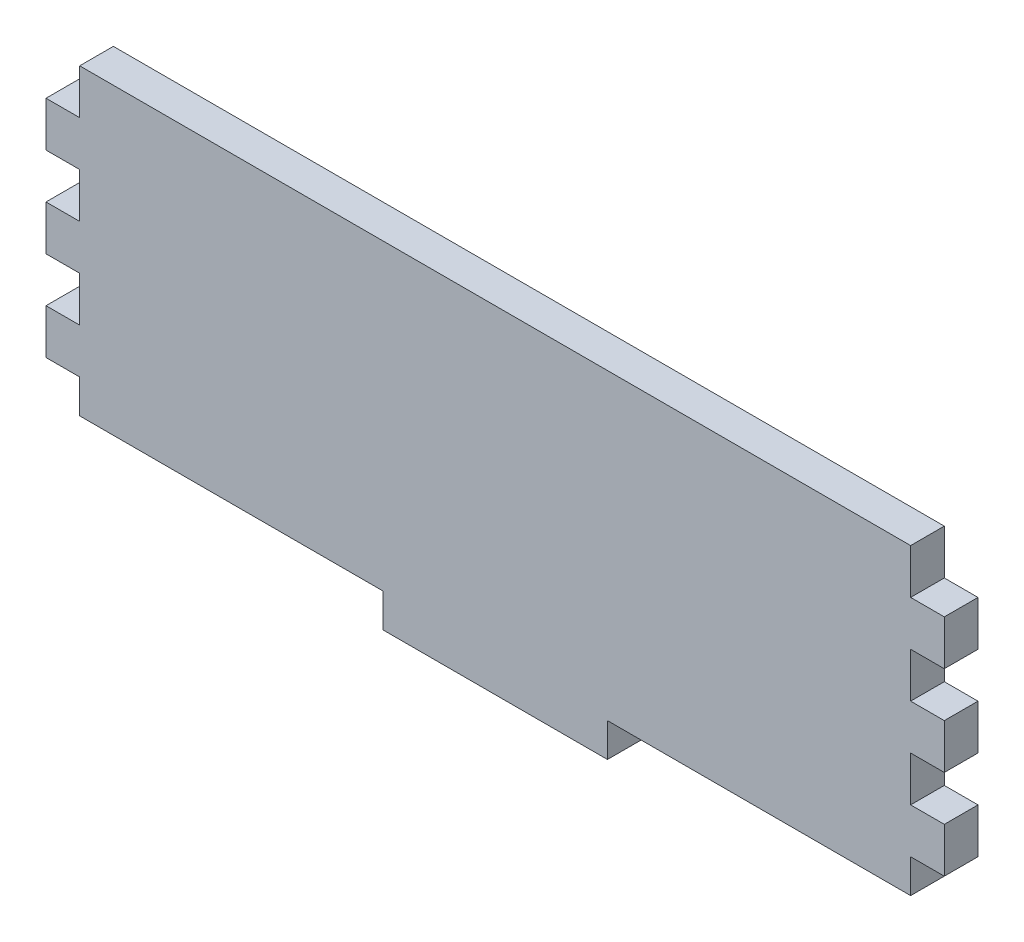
ISO-10303-21;
HEADER;
FILE_DESCRIPTION(('STEP AP214'),'2;1');
FILE_NAME('part.step','',(''),(''),'','','');
FILE_SCHEMA(('AUTOMOTIVE_DESIGN { 1 0 10303 214 1 1 1 1 }'));
ENDSEC;
DATA;
#1=APPLICATION_CONTEXT('core data for automotive mechanical design processes');
#2=APPLICATION_PROTOCOL_DEFINITION('international standard','automotive_design',2000,#1);
#3=PRODUCT_CONTEXT('',#1,'mechanical');
#4=PRODUCT('Part','Part','',(#3));
#5=PRODUCT_RELATED_PRODUCT_CATEGORY('part','',(#4));
#6=PRODUCT_DEFINITION_FORMATION('','',#4);
#7=PRODUCT_DEFINITION_CONTEXT('part definition',#1,'design');
#8=PRODUCT_DEFINITION('design','',#6,#7);
#9=PRODUCT_DEFINITION_SHAPE('','',#8);
#10=(LENGTH_UNIT() NAMED_UNIT(*) SI_UNIT(.MILLI.,.METRE.));
#11=(NAMED_UNIT(*) PLANE_ANGLE_UNIT() SI_UNIT($,.RADIAN.));
#12=(NAMED_UNIT(*) SI_UNIT($,.STERADIAN.) SOLID_ANGLE_UNIT());
#13=UNCERTAINTY_MEASURE_WITH_UNIT(LENGTH_MEASURE(1.E-05),#10,'distance_accuracy_value','');
#14=(GEOMETRIC_REPRESENTATION_CONTEXT(3) GLOBAL_UNCERTAINTY_ASSIGNED_CONTEXT((#13)) GLOBAL_UNIT_ASSIGNED_CONTEXT((#10,
#11,#12)) REPRESENTATION_CONTEXT('',''));
#15=CARTESIAN_POINT('',(0.,0.,0.));
#16=DIRECTION('',(0.,0.,1.));
#17=DIRECTION('',(1.,0.,0.));
#18=AXIS2_PLACEMENT_3D('',#15,#16,#17);
#19=CARTESIAN_POINT('',(200.,-60.,15.));
#20=DIRECTION('',(-1.,0.,0.));
#21=DIRECTION('',(0.,-1.,0.));
#22=AXIS2_PLACEMENT_3D('',#19,#20,#21);
#23=PLANE('',#22);
#24=DIRECTION('',(0.,1.,0.));
#25=VECTOR('',#24,1.);
#26=CARTESIAN_POINT('',(200.,-60.,0.));
#27=LINE('',#26,#25);
#28=CARTESIAN_POINT('',(200.,35.,0.));
#29=VERTEX_POINT('',#28);
#30=CARTESIAN_POINT('',(200.,55.,0.));
#31=VERTEX_POINT('',#30);
#32=EDGE_CURVE('E267',#29,#31,#27,.T.);
#33=ORIENTED_EDGE('',*,*,#32,.T.);
#34=DIRECTION('',(0.,0.,1.));
#35=VECTOR('',#34,1.);
#36=CARTESIAN_POINT('',(200.,55.,0.));
#37=LINE('',#36,#35);
#38=CARTESIAN_POINT('',(200.,55.,15.));
#39=VERTEX_POINT('',#38);
#40=EDGE_CURVE('E275',#31,#39,#37,.T.);
#41=ORIENTED_EDGE('',*,*,#40,.T.);
#42=DIRECTION('',(0.,1.,0.));
#43=VECTOR('',#42,1.);
#44=CARTESIAN_POINT('',(200.,-60.,15.));
#45=LINE('',#44,#43);
#46=CARTESIAN_POINT('',(200.,35.,15.));
#47=VERTEX_POINT('',#46);
#48=EDGE_CURVE('E432',#47,#39,#45,.T.);
#49=ORIENTED_EDGE('',*,*,#48,.F.);
#50=DIRECTION('',(0.,0.,1.));
#51=VECTOR('',#50,1.);
#52=CARTESIAN_POINT('',(200.,35.,0.));
#53=LINE('',#52,#51);
#54=EDGE_CURVE('E277',#29,#47,#53,.T.);
#55=ORIENTED_EDGE('',*,*,#54,.F.);
#56=EDGE_LOOP('',(#33,#41,#49,#55));
#57=FACE_BOUND('',#56,.T.);
#58=ADVANCED_FACE('F33',(#57),#23,.F.);
#59=CARTESIAN_POINT('',(200.,-5.00000000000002,0.));
#60=VERTEX_POINT('',#59);
#61=CARTESIAN_POINT('',(200.,15.,0.));
#62=VERTEX_POINT('',#61);
#63=EDGE_CURVE('E457',#60,#62,#27,.T.);
#64=ORIENTED_EDGE('',*,*,#63,.T.);
#65=DIRECTION('',(0.,0.,1.));
#66=VECTOR('',#65,1.);
#67=CARTESIAN_POINT('',(200.,15.,0.));
#68=LINE('',#67,#66);
#69=CARTESIAN_POINT('',(200.,15.,15.));
#70=VERTEX_POINT('',#69);
#71=EDGE_CURVE('E280',#62,#70,#68,.T.);
#72=ORIENTED_EDGE('',*,*,#71,.T.);
#73=CARTESIAN_POINT('',(200.,-5.00000000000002,15.));
#74=VERTEX_POINT('',#73);
#75=EDGE_CURVE('E436',#74,#70,#45,.T.);
#76=ORIENTED_EDGE('',*,*,#75,.F.);
#77=DIRECTION('',(0.,0.,1.));
#78=VECTOR('',#77,1.);
#79=CARTESIAN_POINT('',(200.,-5.00000000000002,0.));
#80=LINE('',#79,#78);
#81=EDGE_CURVE('E374',#60,#74,#80,.T.);
#82=ORIENTED_EDGE('',*,*,#81,.F.);
#83=EDGE_LOOP('',(#64,#72,#76,#82));
#84=FACE_BOUND('',#83,.T.);
#85=ADVANCED_FACE('F550',(#84),#23,.F.);
#86=CARTESIAN_POINT('',(-200.,-60.,15.));
#87=DIRECTION('',(-1.,0.,0.));
#88=DIRECTION('',(0.,0.,1.));
#89=AXIS2_PLACEMENT_3D('',#86,#87,#88);
#90=PLANE('',#89);
#91=DIRECTION('',(0.,0.,1.));
#92=VECTOR('',#91,1.);
#93=CARTESIAN_POINT('',(-200.,-5.00000000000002,0.));
#94=LINE('',#93,#92);
#95=CARTESIAN_POINT('',(-200.,-5.00000000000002,0.));
#96=VERTEX_POINT('',#95);
#97=CARTESIAN_POINT('',(-200.,-5.00000000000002,15.));
#98=VERTEX_POINT('',#97);
#99=EDGE_CURVE('E346',#96,#98,#94,.T.);
#100=ORIENTED_EDGE('',*,*,#99,.T.);
#101=DIRECTION('',(0.,1.,0.));
#102=VECTOR('',#101,1.);
#103=CARTESIAN_POINT('',(-200.,-60.,15.));
#104=LINE('',#103,#102);
#105=CARTESIAN_POINT('',(-200.,15.,15.));
#106=VERTEX_POINT('',#105);
#107=EDGE_CURVE('E442',#98,#106,#104,.T.);
#108=ORIENTED_EDGE('',*,*,#107,.T.);
#109=DIRECTION('',(0.,0.,1.));
#110=VECTOR('',#109,1.);
#111=CARTESIAN_POINT('',(-200.,15.,0.));
#112=LINE('',#111,#110);
#113=CARTESIAN_POINT('',(-200.,15.,0.));
#114=VERTEX_POINT('',#113);
#115=EDGE_CURVE('E341',#114,#106,#112,.T.);
#116=ORIENTED_EDGE('',*,*,#115,.F.);
#117=DIRECTION('',(0.,1.,0.));
#118=VECTOR('',#117,1.);
#119=CARTESIAN_POINT('',(-200.,-60.,0.));
#120=LINE('',#119,#118);
#121=EDGE_CURVE('E463',#96,#114,#120,.T.);
#122=ORIENTED_EDGE('',*,*,#121,.F.);
#123=EDGE_LOOP('',(#100,#108,#116,#122));
#124=FACE_BOUND('',#123,.T.);
#125=ADVANCED_FACE('F522',(#124),#90,.T.);
#126=DIRECTION('',(0.,0.,1.));
#127=VECTOR('',#126,1.);
#128=CARTESIAN_POINT('',(-200.,35.,0.));
#129=LINE('',#128,#127);
#130=CARTESIAN_POINT('',(-200.,35.,0.));
#131=VERTEX_POINT('',#130);
#132=CARTESIAN_POINT('',(-200.,35.,15.));
#133=VERTEX_POINT('',#132);
#134=EDGE_CURVE('E350',#131,#133,#129,.T.);
#135=ORIENTED_EDGE('',*,*,#134,.T.);
#136=CARTESIAN_POINT('',(-200.,55.,15.));
#137=VERTEX_POINT('',#136);
#138=EDGE_CURVE('E440',#133,#137,#104,.T.);
#139=ORIENTED_EDGE('',*,*,#138,.T.);
#140=DIRECTION('',(0.,0.,1.));
#141=VECTOR('',#140,1.);
#142=CARTESIAN_POINT('',(-200.,55.,0.));
#143=LINE('',#142,#141);
#144=CARTESIAN_POINT('',(-200.,55.,0.));
#145=VERTEX_POINT('',#144);
#146=EDGE_CURVE('E416',#145,#137,#143,.T.);
#147=ORIENTED_EDGE('',*,*,#146,.F.);
#148=EDGE_CURVE('E461',#131,#145,#120,.T.);
#149=ORIENTED_EDGE('',*,*,#148,.F.);
#150=EDGE_LOOP('',(#135,#139,#147,#149));
#151=FACE_BOUND('',#150,.T.);
#152=ADVANCED_FACE('F566',(#151),#90,.T.);
#153=CARTESIAN_POINT('',(50.,-60.,15.));
#154=DIRECTION('',(0.,1.,0.));
#155=DIRECTION('',(0.,0.,1.));
#156=AXIS2_PLACEMENT_3D('',#153,#154,#155);
#157=PLANE('',#156);
#158=DIRECTION('',(1.,0.,0.));
#159=VECTOR('',#158,1.);
#160=CARTESIAN_POINT('',(50.,-60.,0.));
#161=LINE('',#160,#159);
#162=CARTESIAN_POINT('',(50.,-60.,0.));
#163=VERTEX_POINT('',#162);
#164=CARTESIAN_POINT('',(185.,-60.,0.));
#165=VERTEX_POINT('',#164);
#166=EDGE_CURVE('E424',#163,#165,#161,.T.);
#167=ORIENTED_EDGE('',*,*,#166,.T.);
#168=DIRECTION('',(0.,0.,1.));
#169=VECTOR('',#168,1.);
#170=CARTESIAN_POINT('',(185.,-60.,0.));
#171=LINE('',#170,#169);
#172=CARTESIAN_POINT('',(185.,-60.,15.));
#173=VERTEX_POINT('',#172);
#174=EDGE_CURVE('E310',#165,#173,#171,.T.);
#175=ORIENTED_EDGE('',*,*,#174,.T.);
#176=DIRECTION('',(1.,0.,0.));
#177=VECTOR('',#176,1.);
#178=CARTESIAN_POINT('',(50.,-60.,15.));
#179=LINE('',#178,#177);
#180=CARTESIAN_POINT('',(50.,-60.,15.));
#181=VERTEX_POINT('',#180);
#182=EDGE_CURVE('E429',#181,#173,#179,.T.);
#183=ORIENTED_EDGE('',*,*,#182,.F.);
#184=DIRECTION('',(0.,0.,-1.));
#185=VECTOR('',#184,1.);
#186=CARTESIAN_POINT('',(50.,-60.,15.));
#187=LINE('',#186,#185);
#188=EDGE_CURVE('E453',#181,#163,#187,.T.);
#189=ORIENTED_EDGE('',*,*,#188,.T.);
#190=EDGE_LOOP('',(#167,#175,#183,#189));
#191=FACE_BOUND('',#190,.T.);
#192=ADVANCED_FACE('F35',(#191),#157,.F.);
#193=CARTESIAN_POINT('',(200.,-45.,15.));
#194=VERTEX_POINT('',#193);
#195=CARTESIAN_POINT('',(200.,-25.,15.));
#196=VERTEX_POINT('',#195);
#197=EDGE_CURVE('E437',#194,#196,#45,.T.);
#198=ORIENTED_EDGE('',*,*,#197,.F.);
#199=DIRECTION('',(0.,0.,1.));
#200=VECTOR('',#199,1.);
#201=CARTESIAN_POINT('',(200.,-45.,0.));
#202=LINE('',#201,#200);
#203=CARTESIAN_POINT('',(200.,-45.,0.));
#204=VERTEX_POINT('',#203);
#205=EDGE_CURVE('E321',#204,#194,#202,.T.);
#206=ORIENTED_EDGE('',*,*,#205,.F.);
#207=CARTESIAN_POINT('',(200.,-25.,0.));
#208=VERTEX_POINT('',#207);
#209=EDGE_CURVE('E458',#204,#208,#27,.T.);
#210=ORIENTED_EDGE('',*,*,#209,.T.);
#211=DIRECTION('',(0.,0.,1.));
#212=VECTOR('',#211,1.);
#213=CARTESIAN_POINT('',(200.,-25.,0.));
#214=LINE('',#213,#212);
#215=EDGE_CURVE('E403',#208,#196,#214,.T.);
#216=ORIENTED_EDGE('',*,*,#215,.T.);
#217=EDGE_LOOP('',(#198,#206,#210,#216));
#218=FACE_BOUND('',#217,.T.);
#219=ADVANCED_FACE('F552',(#218),#23,.F.);
#220=CARTESIAN_POINT('',(200.,75.,15.));
#221=DIRECTION('',(0.,-1.,0.));
#222=DIRECTION('',(1.,0.,0.));
#223=AXIS2_PLACEMENT_3D('',#220,#221,#222);
#224=PLANE('',#223);
#225=DIRECTION('',(-1.,0.,0.));
#226=VECTOR('',#225,1.);
#227=CARTESIAN_POINT('',(200.,75.,15.));
#228=LINE('',#227,#226);
#229=CARTESIAN_POINT('',(185.,75.,15.));
#230=VERTEX_POINT('',#229);
#231=CARTESIAN_POINT('',(-185.,75.,15.));
#232=VERTEX_POINT('',#231);
#233=EDGE_CURVE('E438',#230,#232,#228,.T.);
#234=ORIENTED_EDGE('',*,*,#233,.F.);
#235=DIRECTION('',(0.,0.,1.));
#236=VECTOR('',#235,1.);
#237=CARTESIAN_POINT('',(185.,75.,0.));
#238=LINE('',#237,#236);
#239=CARTESIAN_POINT('',(185.,75.,0.));
#240=VERTEX_POINT('',#239);
#241=EDGE_CURVE('E290',#240,#230,#238,.T.);
#242=ORIENTED_EDGE('',*,*,#241,.F.);
#243=DIRECTION('',(-1.,0.,0.));
#244=VECTOR('',#243,1.);
#245=CARTESIAN_POINT('',(200.,75.,0.));
#246=LINE('',#245,#244);
#247=CARTESIAN_POINT('',(-185.,75.,0.));
#248=VERTEX_POINT('',#247);
#249=EDGE_CURVE('E459',#240,#248,#246,.T.);
#250=ORIENTED_EDGE('',*,*,#249,.T.);
#251=DIRECTION('',(0.,0.,1.));
#252=VECTOR('',#251,1.);
#253=CARTESIAN_POINT('',(-185.,75.,0.));
#254=LINE('',#253,#252);
#255=EDGE_CURVE('E421',#248,#232,#254,.T.);
#256=ORIENTED_EDGE('',*,*,#255,.T.);
#257=EDGE_LOOP('',(#234,#242,#250,#256));
#258=FACE_BOUND('',#257,.T.);
#259=ADVANCED_FACE('F559',(#258),#224,.F.);
#260=DIRECTION('',(0.,0.,1.));
#261=VECTOR('',#260,1.);
#262=CARTESIAN_POINT('',(-200.,-45.,0.));
#263=LINE('',#262,#261);
#264=CARTESIAN_POINT('',(-200.,-45.,0.));
#265=VERTEX_POINT('',#264);
#266=CARTESIAN_POINT('',(-200.,-45.,15.));
#267=VERTEX_POINT('',#266);
#268=EDGE_CURVE('E294',#265,#267,#263,.T.);
#269=ORIENTED_EDGE('',*,*,#268,.T.);
#270=CARTESIAN_POINT('',(-200.,-25.,15.));
#271=VERTEX_POINT('',#270);
#272=EDGE_CURVE('E443',#267,#271,#104,.T.);
#273=ORIENTED_EDGE('',*,*,#272,.T.);
#274=DIRECTION('',(0.,0.,1.));
#275=VECTOR('',#274,1.);
#276=CARTESIAN_POINT('',(-200.,-25.,0.));
#277=LINE('',#276,#275);
#278=CARTESIAN_POINT('',(-200.,-25.,0.));
#279=VERTEX_POINT('',#278);
#280=EDGE_CURVE('E369',#279,#271,#277,.T.);
#281=ORIENTED_EDGE('',*,*,#280,.F.);
#282=EDGE_CURVE('E464',#265,#279,#120,.T.);
#283=ORIENTED_EDGE('',*,*,#282,.F.);
#284=EDGE_LOOP('',(#269,#273,#281,#283));
#285=FACE_BOUND('',#284,.T.);
#286=ADVANCED_FACE('F514',(#285),#90,.T.);
#287=CARTESIAN_POINT('',(-200.,-60.,15.));
#288=DIRECTION('',(0.,1.,0.));
#289=DIRECTION('',(0.,0.,1.));
#290=AXIS2_PLACEMENT_3D('',#287,#288,#289);
#291=PLANE('',#290);
#292=DIRECTION('',(1.,0.,0.));
#293=VECTOR('',#292,1.);
#294=CARTESIAN_POINT('',(-200.,-60.,15.));
#295=LINE('',#294,#293);
#296=CARTESIAN_POINT('',(-185.,-60.,15.));
#297=VERTEX_POINT('',#296);
#298=CARTESIAN_POINT('',(-50.,-60.,15.));
#299=VERTEX_POINT('',#298);
#300=EDGE_CURVE('E444',#297,#299,#295,.T.);
#301=ORIENTED_EDGE('',*,*,#300,.F.);
#302=DIRECTION('',(0.,0.,1.));
#303=VECTOR('',#302,1.);
#304=CARTESIAN_POINT('',(-185.,-60.,0.));
#305=LINE('',#304,#303);
#306=CARTESIAN_POINT('',(-185.,-60.,0.));
#307=VERTEX_POINT('',#306);
#308=EDGE_CURVE('E306',#307,#297,#305,.T.);
#309=ORIENTED_EDGE('',*,*,#308,.F.);
#310=DIRECTION('',(1.,0.,0.));
#311=VECTOR('',#310,1.);
#312=CARTESIAN_POINT('',(-200.,-60.,0.));
#313=LINE('',#312,#311);
#314=CARTESIAN_POINT('',(-50.,-60.,0.));
#315=VERTEX_POINT('',#314);
#316=EDGE_CURVE('E465',#307,#315,#313,.T.);
#317=ORIENTED_EDGE('',*,*,#316,.T.);
#318=DIRECTION('',(0.,0.,-1.));
#319=VECTOR('',#318,1.);
#320=CARTESIAN_POINT('',(-50.,-60.,15.));
#321=LINE('',#320,#319);
#322=EDGE_CURVE('E11',#299,#315,#321,.T.);
#323=ORIENTED_EDGE('',*,*,#322,.F.);
#324=EDGE_LOOP('',(#301,#309,#317,#323));
#325=FACE_BOUND('',#324,.T.);
#326=ADVANCED_FACE('F505',(#325),#291,.F.);
#327=CARTESIAN_POINT('',(-50.,-60.,15.));
#328=DIRECTION('',(1.,0.,0.));
#329=DIRECTION('',(0.,1.,0.));
#330=AXIS2_PLACEMENT_3D('',#327,#328,#329);
#331=PLANE('',#330);
#332=DIRECTION('',(0.,-1.,0.));
#333=VECTOR('',#332,1.);
#334=CARTESIAN_POINT('',(-50.,-60.,0.));
#335=LINE('',#334,#333);
#336=CARTESIAN_POINT('',(-50.,-75.,0.));
#337=VERTEX_POINT('',#336);
#338=EDGE_CURVE('E467',#315,#337,#335,.T.);
#339=ORIENTED_EDGE('',*,*,#338,.T.);
#340=DIRECTION('',(0.,0.,-1.));
#341=VECTOR('',#340,1.);
#342=CARTESIAN_POINT('',(-50.,-75.,15.));
#343=LINE('',#342,#341);
#344=CARTESIAN_POINT('',(-50.,-75.,15.));
#345=VERTEX_POINT('',#344);
#346=EDGE_CURVE('E41',#345,#337,#343,.T.);
#347=ORIENTED_EDGE('',*,*,#346,.F.);
#348=DIRECTION('',(0.,-1.,0.));
#349=VECTOR('',#348,1.);
#350=CARTESIAN_POINT('',(-50.,-60.,15.));
#351=LINE('',#350,#349);
#352=EDGE_CURVE('E446',#299,#345,#351,.T.);
#353=ORIENTED_EDGE('',*,*,#352,.F.);
#354=ORIENTED_EDGE('',*,*,#322,.T.);
#355=EDGE_LOOP('',(#339,#347,#353,#354));
#356=FACE_BOUND('',#355,.T.);
#357=ADVANCED_FACE('F485',(#356),#331,.F.);
#358=CARTESIAN_POINT('',(50.,-75.,15.));
#359=DIRECTION('',(0.,-1.,0.));
#360=DIRECTION('',(0.,0.,-1.));
#361=AXIS2_PLACEMENT_3D('',#358,#359,#360);
#362=PLANE('',#361);
#363=DIRECTION('',(-1.,0.,0.));
#364=VECTOR('',#363,1.);
#365=CARTESIAN_POINT('',(50.,-75.,0.));
#366=LINE('',#365,#364);
#367=CARTESIAN_POINT('',(50.,-75.,0.));
#368=VERTEX_POINT('',#367);
#369=EDGE_CURVE('E470',#368,#337,#366,.T.);
#370=ORIENTED_EDGE('',*,*,#369,.F.);
#371=DIRECTION('',(0.,0.,-1.));
#372=VECTOR('',#371,1.);
#373=CARTESIAN_POINT('',(50.,-75.,15.));
#374=LINE('',#373,#372);
#375=CARTESIAN_POINT('',(50.,-75.,15.));
#376=VERTEX_POINT('',#375);
#377=EDGE_CURVE('E476',#376,#368,#374,.T.);
#378=ORIENTED_EDGE('',*,*,#377,.F.);
#379=DIRECTION('',(-1.,0.,0.));
#380=VECTOR('',#379,1.);
#381=CARTESIAN_POINT('',(50.,-75.,15.));
#382=LINE('',#381,#380);
#383=EDGE_CURVE('E448',#376,#345,#382,.T.);
#384=ORIENTED_EDGE('',*,*,#383,.T.);
#385=ORIENTED_EDGE('',*,*,#346,.T.);
#386=EDGE_LOOP('',(#370,#378,#384,#385));
#387=FACE_BOUND('',#386,.T.);
#388=ADVANCED_FACE('F480',(#387),#362,.T.);
#389=CARTESIAN_POINT('',(50.,-75.,15.));
#390=DIRECTION('',(-1.,0.,0.));
#391=DIRECTION('',(0.,-1.,0.));
#392=AXIS2_PLACEMENT_3D('',#389,#390,#391);
#393=PLANE('',#392);
#394=DIRECTION('',(0.,1.,0.));
#395=VECTOR('',#394,1.);
#396=CARTESIAN_POINT('',(50.,-75.,0.));
#397=LINE('',#396,#395);
#398=EDGE_CURVE('E433',#368,#163,#397,.T.);
#399=ORIENTED_EDGE('',*,*,#398,.T.);
#400=ORIENTED_EDGE('',*,*,#188,.F.);
#401=DIRECTION('',(0.,1.,0.));
#402=VECTOR('',#401,1.);
#403=CARTESIAN_POINT('',(50.,-75.,15.));
#404=LINE('',#403,#402);
#405=EDGE_CURVE('E451',#376,#181,#404,.T.);
#406=ORIENTED_EDGE('',*,*,#405,.F.);
#407=ORIENTED_EDGE('',*,*,#377,.T.);
#408=EDGE_LOOP('',(#399,#400,#406,#407));
#409=FACE_BOUND('',#408,.T.);
#410=ADVANCED_FACE('F492',(#409),#393,.F.);
#411=CARTESIAN_POINT('',(0.,0.,15.));
#412=DIRECTION('',(0.,0.,1.));
#413=DIRECTION('',(1.,0.,0.));
#414=AXIS2_PLACEMENT_3D('',#411,#412,#413);
#415=PLANE('',#414);
#416=DIRECTION('',(0.,-1.,0.));
#417=VECTOR('',#416,1.);
#418=CARTESIAN_POINT('',(185.,-45.,15.));
#419=LINE('',#418,#417);
#420=CARTESIAN_POINT('',(185.,-45.,15.));
#421=VERTEX_POINT('',#420);
#422=EDGE_CURVE('E319',#421,#173,#419,.T.);
#423=ORIENTED_EDGE('',*,*,#422,.F.);
#424=DIRECTION('',(-1.,0.,0.));
#425=VECTOR('',#424,1.);
#426=CARTESIAN_POINT('',(200.,-45.,15.));
#427=LINE('',#426,#425);
#428=EDGE_CURVE('E322',#194,#421,#427,.T.);
#429=ORIENTED_EDGE('',*,*,#428,.F.);
#430=ORIENTED_EDGE('',*,*,#197,.T.);
#431=DIRECTION('',(1.,0.,0.));
#432=VECTOR('',#431,1.);
#433=CARTESIAN_POINT('',(200.,-25.,15.));
#434=LINE('',#433,#432);
#435=CARTESIAN_POINT('',(185.,-25.,15.));
#436=VERTEX_POINT('',#435);
#437=EDGE_CURVE('E389',#436,#196,#434,.T.);
#438=ORIENTED_EDGE('',*,*,#437,.F.);
#439=DIRECTION('',(0.,-1.,0.));
#440=VECTOR('',#439,1.);
#441=CARTESIAN_POINT('',(185.,-5.00000000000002,15.));
#442=LINE('',#441,#440);
#443=CARTESIAN_POINT('',(185.,-5.00000000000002,15.));
#444=VERTEX_POINT('',#443);
#445=EDGE_CURVE('E398',#444,#436,#442,.T.);
#446=ORIENTED_EDGE('',*,*,#445,.F.);
#447=DIRECTION('',(-1.,0.,0.));
#448=VECTOR('',#447,1.);
#449=CARTESIAN_POINT('',(200.,-5.00000000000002,15.));
#450=LINE('',#449,#448);
#451=EDGE_CURVE('E279',#74,#444,#450,.T.);
#452=ORIENTED_EDGE('',*,*,#451,.F.);
#453=ORIENTED_EDGE('',*,*,#75,.T.);
#454=DIRECTION('',(1.,0.,0.));
#455=VECTOR('',#454,1.);
#456=CARTESIAN_POINT('',(200.,15.,15.));
#457=LINE('',#456,#455);
#458=CARTESIAN_POINT('',(185.,15.,15.));
#459=VERTEX_POINT('',#458);
#460=EDGE_CURVE('E268',#459,#70,#457,.T.);
#461=ORIENTED_EDGE('',*,*,#460,.F.);
#462=DIRECTION('',(0.,-1.,0.));
#463=VECTOR('',#462,1.);
#464=CARTESIAN_POINT('',(185.,35.,15.));
#465=LINE('',#464,#463);
#466=CARTESIAN_POINT('',(185.,35.,15.));
#467=VERTEX_POINT('',#466);
#468=EDGE_CURVE('E270',#467,#459,#465,.T.);
#469=ORIENTED_EDGE('',*,*,#468,.F.);
#470=DIRECTION('',(-1.,0.,0.));
#471=VECTOR('',#470,1.);
#472=CARTESIAN_POINT('',(200.,35.,15.));
#473=LINE('',#472,#471);
#474=EDGE_CURVE('E248',#47,#467,#473,.T.);
#475=ORIENTED_EDGE('',*,*,#474,.F.);
#476=ORIENTED_EDGE('',*,*,#48,.T.);
#477=DIRECTION('',(1.,0.,0.));
#478=VECTOR('',#477,1.);
#479=CARTESIAN_POINT('',(200.,55.,15.));
#480=LINE('',#479,#478);
#481=CARTESIAN_POINT('',(185.,55.,15.));
#482=VERTEX_POINT('',#481);
#483=EDGE_CURVE('E288',#482,#39,#480,.T.);
#484=ORIENTED_EDGE('',*,*,#483,.F.);
#485=DIRECTION('',(0.,-1.,0.));
#486=VECTOR('',#485,1.);
#487=CARTESIAN_POINT('',(185.,75.,15.));
#488=LINE('',#487,#486);
#489=EDGE_CURVE('E291',#230,#482,#488,.T.);
#490=ORIENTED_EDGE('',*,*,#489,.F.);
#491=ORIENTED_EDGE('',*,*,#233,.T.);
#492=DIRECTION('',(0.,1.,0.));
#493=VECTOR('',#492,1.);
#494=CARTESIAN_POINT('',(-185.,75.,15.));
#495=LINE('',#494,#493);
#496=CARTESIAN_POINT('',(-185.,55.,15.));
#497=VERTEX_POINT('',#496);
#498=EDGE_CURVE('E413',#497,#232,#495,.T.);
#499=ORIENTED_EDGE('',*,*,#498,.F.);
#500=DIRECTION('',(1.,0.,0.));
#501=VECTOR('',#500,1.);
#502=CARTESIAN_POINT('',(-200.,55.,15.));
#503=LINE('',#502,#501);
#504=EDGE_CURVE('E353',#137,#497,#503,.T.);
#505=ORIENTED_EDGE('',*,*,#504,.F.);
#506=ORIENTED_EDGE('',*,*,#138,.F.);
#507=DIRECTION('',(-1.,0.,0.));
#508=VECTOR('',#507,1.);
#509=CARTESIAN_POINT('',(-200.,35.,15.));
#510=LINE('',#509,#508);
#511=CARTESIAN_POINT('',(-185.,35.,15.));
#512=VERTEX_POINT('',#511);
#513=EDGE_CURVE('E335',#512,#133,#510,.T.);
#514=ORIENTED_EDGE('',*,*,#513,.F.);
#515=DIRECTION('',(0.,1.,0.));
#516=VECTOR('',#515,1.);
#517=CARTESIAN_POINT('',(-185.,35.,15.));
#518=LINE('',#517,#516);
#519=CARTESIAN_POINT('',(-185.,15.,15.));
#520=VERTEX_POINT('',#519);
#521=EDGE_CURVE('E345',#520,#512,#518,.T.);
#522=ORIENTED_EDGE('',*,*,#521,.F.);
#523=DIRECTION('',(1.,0.,0.));
#524=VECTOR('',#523,1.);
#525=CARTESIAN_POINT('',(-200.,15.,15.));
#526=LINE('',#525,#524);
#527=EDGE_CURVE('E342',#106,#520,#526,.T.);
#528=ORIENTED_EDGE('',*,*,#527,.F.);
#529=ORIENTED_EDGE('',*,*,#107,.F.);
#530=DIRECTION('',(-1.,0.,0.));
#531=VECTOR('',#530,1.);
#532=CARTESIAN_POINT('',(-200.,-5.00000000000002,15.));
#533=LINE('',#532,#531);
#534=CARTESIAN_POINT('',(-185.,-5.00000000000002,15.));
#535=VERTEX_POINT('',#534);
#536=EDGE_CURVE('E363',#535,#98,#533,.T.);
#537=ORIENTED_EDGE('',*,*,#536,.F.);
#538=DIRECTION('',(0.,1.,0.));
#539=VECTOR('',#538,1.);
#540=CARTESIAN_POINT('',(-185.,-5.00000000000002,15.));
#541=LINE('',#540,#539);
#542=CARTESIAN_POINT('',(-185.,-25.,15.));
#543=VERTEX_POINT('',#542);
#544=EDGE_CURVE('E373',#543,#535,#541,.T.);
#545=ORIENTED_EDGE('',*,*,#544,.F.);
#546=DIRECTION('',(1.,0.,0.));
#547=VECTOR('',#546,1.);
#548=CARTESIAN_POINT('',(-200.,-25.,15.));
#549=LINE('',#548,#547);
#550=EDGE_CURVE('E370',#271,#543,#549,.T.);
#551=ORIENTED_EDGE('',*,*,#550,.F.);
#552=ORIENTED_EDGE('',*,*,#272,.F.);
#553=DIRECTION('',(-1.,0.,0.));
#554=VECTOR('',#553,1.);
#555=CARTESIAN_POINT('',(-200.,-45.,15.));
#556=LINE('',#555,#554);
#557=CARTESIAN_POINT('',(-185.,-45.,15.));
#558=VERTEX_POINT('',#557);
#559=EDGE_CURVE('E304',#558,#267,#556,.T.);
#560=ORIENTED_EDGE('',*,*,#559,.F.);
#561=DIRECTION('',(0.,1.,0.));
#562=VECTOR('',#561,1.);
#563=CARTESIAN_POINT('',(-185.,-45.,15.));
#564=LINE('',#563,#562);
#565=EDGE_CURVE('E307',#297,#558,#564,.T.);
#566=ORIENTED_EDGE('',*,*,#565,.F.);
#567=ORIENTED_EDGE('',*,*,#300,.T.);
#568=ORIENTED_EDGE('',*,*,#352,.T.);
#569=ORIENTED_EDGE('',*,*,#383,.F.);
#570=ORIENTED_EDGE('',*,*,#405,.T.);
#571=ORIENTED_EDGE('',*,*,#182,.T.);
#572=EDGE_LOOP('',(#423,#429,#430,#438,#446,#452,#453,#461,#469,#475,#476,#484,#490,#491,#499,
#505,#506,#514,#522,#528,#529,#537,#545,#551,#552,#560,#566,#567,#568,#569,#570,#571));
#573=FACE_BOUND('',#572,.T.);
#574=ADVANCED_FACE('F498',(#573),#415,.T.);
#575=CARTESIAN_POINT('',(0.,0.,0.));
#576=DIRECTION('',(0.,0.,1.));
#577=DIRECTION('',(1.,0.,0.));
#578=AXIS2_PLACEMENT_3D('',#575,#576,#577);
#579=PLANE('',#578);
#580=DIRECTION('',(-1.,0.,0.));
#581=VECTOR('',#580,1.);
#582=CARTESIAN_POINT('',(200.,-45.,0.));
#583=LINE('',#582,#581);
#584=CARTESIAN_POINT('',(185.,-45.,0.));
#585=VERTEX_POINT('',#584);
#586=EDGE_CURVE('E317',#204,#585,#583,.T.);
#587=ORIENTED_EDGE('',*,*,#586,.T.);
#588=DIRECTION('',(0.,-1.,0.));
#589=VECTOR('',#588,1.);
#590=CARTESIAN_POINT('',(185.,-45.,0.));
#591=LINE('',#590,#589);
#592=EDGE_CURVE('E48',#585,#165,#591,.T.);
#593=ORIENTED_EDGE('',*,*,#592,.T.);
#594=ORIENTED_EDGE('',*,*,#166,.F.);
#595=ORIENTED_EDGE('',*,*,#398,.F.);
#596=ORIENTED_EDGE('',*,*,#369,.T.);
#597=ORIENTED_EDGE('',*,*,#338,.F.);
#598=ORIENTED_EDGE('',*,*,#316,.F.);
#599=DIRECTION('',(0.,1.,0.));
#600=VECTOR('',#599,1.);
#601=CARTESIAN_POINT('',(-185.,-45.,0.));
#602=LINE('',#601,#600);
#603=CARTESIAN_POINT('',(-185.,-45.,0.));
#604=VERTEX_POINT('',#603);
#605=EDGE_CURVE('E301',#307,#604,#602,.T.);
#606=ORIENTED_EDGE('',*,*,#605,.T.);
#607=DIRECTION('',(-1.,0.,0.));
#608=VECTOR('',#607,1.);
#609=CARTESIAN_POINT('',(-200.,-45.,0.));
#610=LINE('',#609,#608);
#611=EDGE_CURVE('E56',#604,#265,#610,.T.);
#612=ORIENTED_EDGE('',*,*,#611,.T.);
#613=ORIENTED_EDGE('',*,*,#282,.T.);
#614=DIRECTION('',(1.,0.,0.));
#615=VECTOR('',#614,1.);
#616=CARTESIAN_POINT('',(-200.,-25.,0.));
#617=LINE('',#616,#615);
#618=CARTESIAN_POINT('',(-185.,-25.,0.));
#619=VERTEX_POINT('',#618);
#620=EDGE_CURVE('E359',#279,#619,#617,.T.);
#621=ORIENTED_EDGE('',*,*,#620,.T.);
#622=DIRECTION('',(0.,1.,0.));
#623=VECTOR('',#622,1.);
#624=CARTESIAN_POINT('',(-185.,-5.00000000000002,0.));
#625=LINE('',#624,#623);
#626=CARTESIAN_POINT('',(-185.,-5.00000000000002,0.));
#627=VERTEX_POINT('',#626);
#628=EDGE_CURVE('E362',#619,#627,#625,.T.);
#629=ORIENTED_EDGE('',*,*,#628,.T.);
#630=DIRECTION('',(-1.,0.,0.));
#631=VECTOR('',#630,1.);
#632=CARTESIAN_POINT('',(-200.,-5.00000000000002,0.));
#633=LINE('',#632,#631);
#634=EDGE_CURVE('E366',#627,#96,#633,.T.);
#635=ORIENTED_EDGE('',*,*,#634,.T.);
#636=ORIENTED_EDGE('',*,*,#121,.T.);
#637=DIRECTION('',(1.,0.,0.));
#638=VECTOR('',#637,1.);
#639=CARTESIAN_POINT('',(-200.,15.,0.));
#640=LINE('',#639,#638);
#641=CARTESIAN_POINT('',(-185.,15.,0.));
#642=VERTEX_POINT('',#641);
#643=EDGE_CURVE('E331',#114,#642,#640,.T.);
#644=ORIENTED_EDGE('',*,*,#643,.T.);
#645=DIRECTION('',(0.,1.,0.));
#646=VECTOR('',#645,1.);
#647=CARTESIAN_POINT('',(-185.,35.,0.));
#648=LINE('',#647,#646);
#649=CARTESIAN_POINT('',(-185.,35.,0.));
#650=VERTEX_POINT('',#649);
#651=EDGE_CURVE('E334',#642,#650,#648,.T.);
#652=ORIENTED_EDGE('',*,*,#651,.T.);
#653=DIRECTION('',(-1.,0.,0.));
#654=VECTOR('',#653,1.);
#655=CARTESIAN_POINT('',(-200.,35.,0.));
#656=LINE('',#655,#654);
#657=EDGE_CURVE('E338',#650,#131,#656,.T.);
#658=ORIENTED_EDGE('',*,*,#657,.T.);
#659=ORIENTED_EDGE('',*,*,#148,.T.);
#660=DIRECTION('',(1.,0.,0.));
#661=VECTOR('',#660,1.);
#662=CARTESIAN_POINT('',(-200.,55.,0.));
#663=LINE('',#662,#661);
#664=CARTESIAN_POINT('',(-185.,55.,0.));
#665=VERTEX_POINT('',#664);
#666=EDGE_CURVE('E409',#145,#665,#663,.T.);
#667=ORIENTED_EDGE('',*,*,#666,.T.);
#668=DIRECTION('',(0.,1.,0.));
#669=VECTOR('',#668,1.);
#670=CARTESIAN_POINT('',(-185.,75.,0.));
#671=LINE('',#670,#669);
#672=EDGE_CURVE('E412',#665,#248,#671,.T.);
#673=ORIENTED_EDGE('',*,*,#672,.T.);
#674=ORIENTED_EDGE('',*,*,#249,.F.);
#675=DIRECTION('',(0.,-1.,0.));
#676=VECTOR('',#675,1.);
#677=CARTESIAN_POINT('',(185.,75.,0.));
#678=LINE('',#677,#676);
#679=CARTESIAN_POINT('',(185.,55.,0.));
#680=VERTEX_POINT('',#679);
#681=EDGE_CURVE('E284',#240,#680,#678,.T.);
#682=ORIENTED_EDGE('',*,*,#681,.T.);
#683=DIRECTION('',(1.,0.,0.));
#684=VECTOR('',#683,1.);
#685=CARTESIAN_POINT('',(200.,55.,0.));
#686=LINE('',#685,#684);
#687=EDGE_CURVE('E287',#680,#31,#686,.T.);
#688=ORIENTED_EDGE('',*,*,#687,.T.);
#689=ORIENTED_EDGE('',*,*,#32,.F.);
#690=DIRECTION('',(-1.,0.,0.));
#691=VECTOR('',#690,1.);
#692=CARTESIAN_POINT('',(200.,35.,0.));
#693=LINE('',#692,#691);
#694=CARTESIAN_POINT('',(185.,35.,0.));
#695=VERTEX_POINT('',#694);
#696=EDGE_CURVE('E245',#29,#695,#693,.T.);
#697=ORIENTED_EDGE('',*,*,#696,.T.);
#698=DIRECTION('',(0.,-1.,0.));
#699=VECTOR('',#698,1.);
#700=CARTESIAN_POINT('',(185.,35.,0.));
#701=LINE('',#700,#699);
#702=CARTESIAN_POINT('',(185.,15.,0.));
#703=VERTEX_POINT('',#702);
#704=EDGE_CURVE('E257',#695,#703,#701,.T.);
#705=ORIENTED_EDGE('',*,*,#704,.T.);
#706=DIRECTION('',(1.,0.,0.));
#707=VECTOR('',#706,1.);
#708=CARTESIAN_POINT('',(200.,15.,0.));
#709=LINE('',#708,#707);
#710=EDGE_CURVE('E253',#703,#62,#709,.T.);
#711=ORIENTED_EDGE('',*,*,#710,.T.);
#712=ORIENTED_EDGE('',*,*,#63,.F.);
#713=DIRECTION('',(-1.,0.,0.));
#714=VECTOR('',#713,1.);
#715=CARTESIAN_POINT('',(200.,-5.00000000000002,0.));
#716=LINE('',#715,#714);
#717=CARTESIAN_POINT('',(185.,-5.00000000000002,0.));
#718=VERTEX_POINT('',#717);
#719=EDGE_CURVE('E385',#60,#718,#716,.T.);
#720=ORIENTED_EDGE('',*,*,#719,.T.);
#721=DIRECTION('',(0.,-1.,0.));
#722=VECTOR('',#721,1.);
#723=CARTESIAN_POINT('',(185.,-5.00000000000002,0.));
#724=LINE('',#723,#722);
#725=CARTESIAN_POINT('',(185.,-25.,0.));
#726=VERTEX_POINT('',#725);
#727=EDGE_CURVE('E388',#718,#726,#724,.T.);
#728=ORIENTED_EDGE('',*,*,#727,.T.);
#729=DIRECTION('',(1.,0.,0.));
#730=VECTOR('',#729,1.);
#731=CARTESIAN_POINT('',(200.,-25.,0.));
#732=LINE('',#731,#730);
#733=EDGE_CURVE('E392',#726,#208,#732,.T.);
#734=ORIENTED_EDGE('',*,*,#733,.T.);
#735=ORIENTED_EDGE('',*,*,#209,.F.);
#736=EDGE_LOOP('',(#587,#593,#594,#595,#596,#597,#598,#606,#612,#613,#621,#629,#635,#636,#644,
#652,#658,#659,#667,#673,#674,#682,#688,#689,#697,#705,#711,#712,#720,#728,#734,#735));
#737=FACE_BOUND('',#736,.T.);
#738=ADVANCED_FACE('F264',(#737),#579,.F.);
#739=CARTESIAN_POINT('',(-185.,75.,0.));
#740=DIRECTION('',(1.,0.,0.));
#741=DIRECTION('',(0.,0.,-1.));
#742=AXIS2_PLACEMENT_3D('',#739,#740,#741);
#743=PLANE('',#742);
#744=ORIENTED_EDGE('',*,*,#498,.T.);
#745=ORIENTED_EDGE('',*,*,#255,.F.);
#746=ORIENTED_EDGE('',*,*,#672,.F.);
#747=DIRECTION('',(0.,0.,1.));
#748=VECTOR('',#747,1.);
#749=CARTESIAN_POINT('',(-185.,55.,0.));
#750=LINE('',#749,#748);
#751=EDGE_CURVE('E425',#665,#497,#750,.T.);
#752=ORIENTED_EDGE('',*,*,#751,.T.);
#753=EDGE_LOOP('',(#744,#745,#746,#752));
#754=FACE_BOUND('',#753,.T.);
#755=ADVANCED_FACE('F601',(#754),#743,.F.);
#756=CARTESIAN_POINT('',(-200.,55.,0.));
#757=DIRECTION('',(0.,-1.,0.));
#758=DIRECTION('',(1.,0.,0.));
#759=AXIS2_PLACEMENT_3D('',#756,#757,#758);
#760=PLANE('',#759);
#761=ORIENTED_EDGE('',*,*,#504,.T.);
#762=ORIENTED_EDGE('',*,*,#751,.F.);
#763=ORIENTED_EDGE('',*,*,#666,.F.);
#764=ORIENTED_EDGE('',*,*,#146,.T.);
#765=EDGE_LOOP('',(#761,#762,#763,#764));
#766=FACE_BOUND('',#765,.T.);
#767=ADVANCED_FACE('F604',(#766),#760,.F.);
#768=CARTESIAN_POINT('',(-200.,35.,0.));
#769=DIRECTION('',(0.,1.,0.));
#770=DIRECTION('',(0.,0.,1.));
#771=AXIS2_PLACEMENT_3D('',#768,#769,#770);
#772=PLANE('',#771);
#773=ORIENTED_EDGE('',*,*,#513,.T.);
#774=ORIENTED_EDGE('',*,*,#134,.F.);
#775=ORIENTED_EDGE('',*,*,#657,.F.);
#776=DIRECTION('',(0.,0.,1.));
#777=VECTOR('',#776,1.);
#778=CARTESIAN_POINT('',(-185.,35.,0.));
#779=LINE('',#778,#777);
#780=EDGE_CURVE('E354',#650,#512,#779,.T.);
#781=ORIENTED_EDGE('',*,*,#780,.T.);
#782=EDGE_LOOP('',(#773,#774,#775,#781));
#783=FACE_BOUND('',#782,.T.);
#784=ADVANCED_FACE('F608',(#783),#772,.F.);
#785=CARTESIAN_POINT('',(-185.,35.,0.));
#786=DIRECTION('',(1.,0.,0.));
#787=DIRECTION('',(0.,0.,-1.));
#788=AXIS2_PLACEMENT_3D('',#785,#786,#787);
#789=PLANE('',#788);
#790=ORIENTED_EDGE('',*,*,#521,.T.);
#791=ORIENTED_EDGE('',*,*,#780,.F.);
#792=ORIENTED_EDGE('',*,*,#651,.F.);
#793=DIRECTION('',(0.,0.,1.));
#794=VECTOR('',#793,1.);
#795=CARTESIAN_POINT('',(-185.,15.,0.));
#796=LINE('',#795,#794);
#797=EDGE_CURVE('E356',#642,#520,#796,.T.);
#798=ORIENTED_EDGE('',*,*,#797,.T.);
#799=EDGE_LOOP('',(#790,#791,#792,#798));
#800=FACE_BOUND('',#799,.T.);
#801=ADVANCED_FACE('F547',(#800),#789,.F.);
#802=CARTESIAN_POINT('',(-200.,15.,0.));
#803=DIRECTION('',(0.,-1.,0.));
#804=DIRECTION('',(0.,0.,-1.));
#805=AXIS2_PLACEMENT_3D('',#802,#803,#804);
#806=PLANE('',#805);
#807=ORIENTED_EDGE('',*,*,#527,.T.);
#808=ORIENTED_EDGE('',*,*,#797,.F.);
#809=ORIENTED_EDGE('',*,*,#643,.F.);
#810=ORIENTED_EDGE('',*,*,#115,.T.);
#811=EDGE_LOOP('',(#807,#808,#809,#810));
#812=FACE_BOUND('',#811,.T.);
#813=ADVANCED_FACE('F531',(#812),#806,.F.);
#814=CARTESIAN_POINT('',(-200.,-5.00000000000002,0.));
#815=DIRECTION('',(0.,1.,0.));
#816=DIRECTION('',(-1.,0.,0.));
#817=AXIS2_PLACEMENT_3D('',#814,#815,#816);
#818=PLANE('',#817);
#819=ORIENTED_EDGE('',*,*,#536,.T.);
#820=ORIENTED_EDGE('',*,*,#99,.F.);
#821=ORIENTED_EDGE('',*,*,#634,.F.);
#822=DIRECTION('',(0.,0.,1.));
#823=VECTOR('',#822,1.);
#824=CARTESIAN_POINT('',(-185.,-5.00000000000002,0.));
#825=LINE('',#824,#823);
#826=EDGE_CURVE('E380',#627,#535,#825,.T.);
#827=ORIENTED_EDGE('',*,*,#826,.T.);
#828=EDGE_LOOP('',(#819,#820,#821,#827));
#829=FACE_BOUND('',#828,.T.);
#830=ADVANCED_FACE('F539',(#829),#818,.F.);
#831=CARTESIAN_POINT('',(-185.,-5.00000000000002,0.));
#832=DIRECTION('',(1.,0.,0.));
#833=DIRECTION('',(0.,0.,-1.));
#834=AXIS2_PLACEMENT_3D('',#831,#832,#833);
#835=PLANE('',#834);
#836=ORIENTED_EDGE('',*,*,#544,.T.);
#837=ORIENTED_EDGE('',*,*,#826,.F.);
#838=ORIENTED_EDGE('',*,*,#628,.F.);
#839=DIRECTION('',(0.,0.,1.));
#840=VECTOR('',#839,1.);
#841=CARTESIAN_POINT('',(-185.,-25.,0.));
#842=LINE('',#841,#840);
#843=EDGE_CURVE('E382',#619,#543,#842,.T.);
#844=ORIENTED_EDGE('',*,*,#843,.T.);
#845=EDGE_LOOP('',(#836,#837,#838,#844));
#846=FACE_BOUND('',#845,.T.);
#847=ADVANCED_FACE('F537',(#846),#835,.F.);
#848=CARTESIAN_POINT('',(-200.,-25.,0.));
#849=DIRECTION('',(0.,-1.,0.));
#850=DIRECTION('',(0.,0.,-1.));
#851=AXIS2_PLACEMENT_3D('',#848,#849,#850);
#852=PLANE('',#851);
#853=ORIENTED_EDGE('',*,*,#550,.T.);
#854=ORIENTED_EDGE('',*,*,#843,.F.);
#855=ORIENTED_EDGE('',*,*,#620,.F.);
#856=ORIENTED_EDGE('',*,*,#280,.T.);
#857=EDGE_LOOP('',(#853,#854,#855,#856));
#858=FACE_BOUND('',#857,.T.);
#859=ADVANCED_FACE('F535',(#858),#852,.F.);
#860=CARTESIAN_POINT('',(200.,-5.00000000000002,0.));
#861=DIRECTION('',(0.,1.,0.));
#862=DIRECTION('',(-1.,0.,0.));
#863=AXIS2_PLACEMENT_3D('',#860,#861,#862);
#864=PLANE('',#863);
#865=ORIENTED_EDGE('',*,*,#451,.T.);
#866=DIRECTION('',(0.,0.,1.));
#867=VECTOR('',#866,1.);
#868=CARTESIAN_POINT('',(185.,-5.00000000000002,0.));
#869=LINE('',#868,#867);
#870=EDGE_CURVE('E395',#718,#444,#869,.T.);
#871=ORIENTED_EDGE('',*,*,#870,.F.);
#872=ORIENTED_EDGE('',*,*,#719,.F.);
#873=ORIENTED_EDGE('',*,*,#81,.T.);
#874=EDGE_LOOP('',(#865,#871,#872,#873));
#875=FACE_BOUND('',#874,.T.);
#876=ADVANCED_FACE('F590',(#875),#864,.F.);
#877=CARTESIAN_POINT('',(200.,-25.,0.));
#878=DIRECTION('',(0.,-1.,0.));
#879=DIRECTION('',(0.,0.,-1.));
#880=AXIS2_PLACEMENT_3D('',#877,#878,#879);
#881=PLANE('',#880);
#882=ORIENTED_EDGE('',*,*,#437,.T.);
#883=ORIENTED_EDGE('',*,*,#215,.F.);
#884=ORIENTED_EDGE('',*,*,#733,.F.);
#885=DIRECTION('',(0.,0.,1.));
#886=VECTOR('',#885,1.);
#887=CARTESIAN_POINT('',(185.,-25.,0.));
#888=LINE('',#887,#886);
#889=EDGE_CURVE('E406',#726,#436,#888,.T.);
#890=ORIENTED_EDGE('',*,*,#889,.T.);
#891=EDGE_LOOP('',(#882,#883,#884,#890));
#892=FACE_BOUND('',#891,.T.);
#893=ADVANCED_FACE('F586',(#892),#881,.F.);
#894=CARTESIAN_POINT('',(185.,-5.00000000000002,0.));
#895=DIRECTION('',(-1.,0.,0.));
#896=DIRECTION('',(0.,0.,1.));
#897=AXIS2_PLACEMENT_3D('',#894,#895,#896);
#898=PLANE('',#897);
#899=ORIENTED_EDGE('',*,*,#445,.T.);
#900=ORIENTED_EDGE('',*,*,#889,.F.);
#901=ORIENTED_EDGE('',*,*,#727,.F.);
#902=ORIENTED_EDGE('',*,*,#870,.T.);
#903=EDGE_LOOP('',(#899,#900,#901,#902));
#904=FACE_BOUND('',#903,.T.);
#905=ADVANCED_FACE('F588',(#904),#898,.F.);
#906=CARTESIAN_POINT('',(200.,35.,0.));
#907=DIRECTION('',(0.,1.,0.));
#908=DIRECTION('',(0.,0.,1.));
#909=AXIS2_PLACEMENT_3D('',#906,#907,#908);
#910=PLANE('',#909);
#911=ORIENTED_EDGE('',*,*,#474,.T.);
#912=DIRECTION('',(0.,0.,1.));
#913=VECTOR('',#912,1.);
#914=CARTESIAN_POINT('',(185.,35.,0.));
#915=LINE('',#914,#913);
#916=EDGE_CURVE('E241',#695,#467,#915,.T.);
#917=ORIENTED_EDGE('',*,*,#916,.F.);
#918=ORIENTED_EDGE('',*,*,#696,.F.);
#919=ORIENTED_EDGE('',*,*,#54,.T.);
#920=EDGE_LOOP('',(#911,#917,#918,#919));
#921=FACE_BOUND('',#920,.T.);
#922=ADVANCED_FACE('F243',(#921),#910,.F.);
#923=CARTESIAN_POINT('',(200.,15.,0.));
#924=DIRECTION('',(0.,-1.,0.));
#925=DIRECTION('',(0.,0.,-1.));
#926=AXIS2_PLACEMENT_3D('',#923,#924,#925);
#927=PLANE('',#926);
#928=ORIENTED_EDGE('',*,*,#460,.T.);
#929=ORIENTED_EDGE('',*,*,#71,.F.);
#930=ORIENTED_EDGE('',*,*,#710,.F.);
#931=DIRECTION('',(0.,0.,1.));
#932=VECTOR('',#931,1.);
#933=CARTESIAN_POINT('',(185.,15.,0.));
#934=LINE('',#933,#932);
#935=EDGE_CURVE('E252',#703,#459,#934,.T.);
#936=ORIENTED_EDGE('',*,*,#935,.T.);
#937=EDGE_LOOP('',(#928,#929,#930,#936));
#938=FACE_BOUND('',#937,.T.);
#939=ADVANCED_FACE('F582',(#938),#927,.F.);
#940=CARTESIAN_POINT('',(185.,35.,0.));
#941=DIRECTION('',(-1.,0.,0.));
#942=DIRECTION('',(0.,0.,1.));
#943=AXIS2_PLACEMENT_3D('',#940,#941,#942);
#944=PLANE('',#943);
#945=ORIENTED_EDGE('',*,*,#468,.T.);
#946=ORIENTED_EDGE('',*,*,#935,.F.);
#947=ORIENTED_EDGE('',*,*,#704,.F.);
#948=ORIENTED_EDGE('',*,*,#916,.T.);
#949=EDGE_LOOP('',(#945,#946,#947,#948));
#950=FACE_BOUND('',#949,.T.);
#951=ADVANCED_FACE('F258',(#950),#944,.F.);
#952=CARTESIAN_POINT('',(200.,55.,0.));
#953=DIRECTION('',(0.,-1.,0.));
#954=DIRECTION('',(1.,0.,0.));
#955=AXIS2_PLACEMENT_3D('',#952,#953,#954);
#956=PLANE('',#955);
#957=ORIENTED_EDGE('',*,*,#483,.T.);
#958=ORIENTED_EDGE('',*,*,#40,.F.);
#959=ORIENTED_EDGE('',*,*,#687,.F.);
#960=DIRECTION('',(0.,0.,1.));
#961=VECTOR('',#960,1.);
#962=CARTESIAN_POINT('',(185.,55.,0.));
#963=LINE('',#962,#961);
#964=EDGE_CURVE('E298',#680,#482,#963,.T.);
#965=ORIENTED_EDGE('',*,*,#964,.T.);
#966=EDGE_LOOP('',(#957,#958,#959,#965));
#967=FACE_BOUND('',#966,.T.);
#968=ADVANCED_FACE('F662',(#967),#956,.F.);
#969=CARTESIAN_POINT('',(185.,75.,0.));
#970=DIRECTION('',(-1.,0.,0.));
#971=DIRECTION('',(0.,0.,1.));
#972=AXIS2_PLACEMENT_3D('',#969,#970,#971);
#973=PLANE('',#972);
#974=ORIENTED_EDGE('',*,*,#489,.T.);
#975=ORIENTED_EDGE('',*,*,#964,.F.);
#976=ORIENTED_EDGE('',*,*,#681,.F.);
#977=ORIENTED_EDGE('',*,*,#241,.T.);
#978=EDGE_LOOP('',(#974,#975,#976,#977));
#979=FACE_BOUND('',#978,.T.);
#980=ADVANCED_FACE('F659',(#979),#973,.F.);
#981=CARTESIAN_POINT('',(-200.,-45.,0.));
#982=DIRECTION('',(0.,1.,0.));
#983=DIRECTION('',(0.,0.,1.));
#984=AXIS2_PLACEMENT_3D('',#981,#982,#983);
#985=PLANE('',#984);
#986=ORIENTED_EDGE('',*,*,#559,.T.);
#987=ORIENTED_EDGE('',*,*,#268,.F.);
#988=ORIENTED_EDGE('',*,*,#611,.F.);
#989=DIRECTION('',(0.,0.,1.));
#990=VECTOR('',#989,1.);
#991=CARTESIAN_POINT('',(-185.,-45.,0.));
#992=LINE('',#991,#990);
#993=EDGE_CURVE('E314',#604,#558,#992,.T.);
#994=ORIENTED_EDGE('',*,*,#993,.T.);
#995=EDGE_LOOP('',(#986,#987,#988,#994));
#996=FACE_BOUND('',#995,.T.);
#997=ADVANCED_FACE('F510',(#996),#985,.F.);
#998=CARTESIAN_POINT('',(-185.,-45.,0.));
#999=DIRECTION('',(1.,0.,0.));
#1000=DIRECTION('',(0.,0.,-1.));
#1001=AXIS2_PLACEMENT_3D('',#998,#999,#1000);
#1002=PLANE('',#1001);
#1003=ORIENTED_EDGE('',*,*,#565,.T.);
#1004=ORIENTED_EDGE('',*,*,#993,.F.);
#1005=ORIENTED_EDGE('',*,*,#605,.F.);
#1006=ORIENTED_EDGE('',*,*,#308,.T.);
#1007=EDGE_LOOP('',(#1003,#1004,#1005,#1006));
#1008=FACE_BOUND('',#1007,.T.);
#1009=ADVANCED_FACE('F509',(#1008),#1002,.F.);
#1010=CARTESIAN_POINT('',(185.,-45.,0.));
#1011=DIRECTION('',(-1.,0.,0.));
#1012=DIRECTION('',(0.,0.,1.));
#1013=AXIS2_PLACEMENT_3D('',#1010,#1011,#1012);
#1014=PLANE('',#1013);
#1015=ORIENTED_EDGE('',*,*,#422,.T.);
#1016=ORIENTED_EDGE('',*,*,#174,.F.);
#1017=ORIENTED_EDGE('',*,*,#592,.F.);
#1018=DIRECTION('',(0.,0.,1.));
#1019=VECTOR('',#1018,1.);
#1020=CARTESIAN_POINT('',(185.,-45.,0.));
#1021=LINE('',#1020,#1019);
#1022=EDGE_CURVE('E328',#585,#421,#1021,.T.);
#1023=ORIENTED_EDGE('',*,*,#1022,.T.);
#1024=EDGE_LOOP('',(#1015,#1016,#1017,#1023));
#1025=FACE_BOUND('',#1024,.T.);
#1026=ADVANCED_FACE('F651',(#1025),#1014,.F.);
#1027=CARTESIAN_POINT('',(200.,-45.,0.));
#1028=DIRECTION('',(0.,1.,0.));
#1029=DIRECTION('',(0.,0.,1.));
#1030=AXIS2_PLACEMENT_3D('',#1027,#1028,#1029);
#1031=PLANE('',#1030);
#1032=ORIENTED_EDGE('',*,*,#428,.T.);
#1033=ORIENTED_EDGE('',*,*,#1022,.F.);
#1034=ORIENTED_EDGE('',*,*,#586,.F.);
#1035=ORIENTED_EDGE('',*,*,#205,.T.);
#1036=EDGE_LOOP('',(#1032,#1033,#1034,#1035));
#1037=FACE_BOUND('',#1036,.T.);
#1038=ADVANCED_FACE('F648',(#1037),#1031,.F.);
#1039=CLOSED_SHELL('',(#58,#85,#125,#152,#192,#219,#259,#286,#326,#357,#388,#410,#574,#738,#755,
#767,#784,#801,#813,#830,#847,#859,#876,#893,#905,#922,#939,#951,#968,#980,#997,#1009,#1026,#1038));
#1040=MANIFOLD_SOLID_BREP('B2',#1039);
#1041=ADVANCED_BREP_SHAPE_REPRESENTATION('',(#18,#1040),#14);
#1042=SHAPE_DEFINITION_REPRESENTATION(#9,#1041);
ENDSEC;
END-ISO-10303-21;
